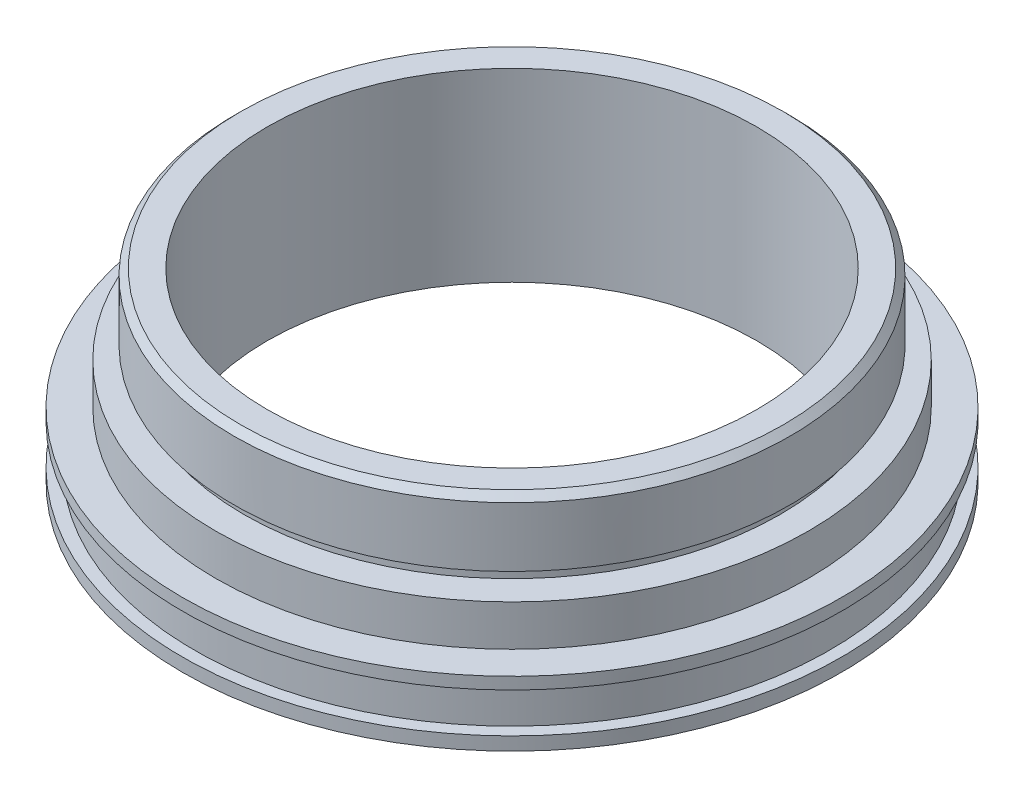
ISO-10303-21;
HEADER;
FILE_DESCRIPTION(('STEP AP214'),'2;1');
FILE_NAME('part.step','',(''),(''),'','','');
FILE_SCHEMA(('AUTOMOTIVE_DESIGN { 1 0 10303 214 1 1 1 1 }'));
ENDSEC;
DATA;
#1=APPLICATION_CONTEXT('core data for automotive mechanical design processes');
#2=APPLICATION_PROTOCOL_DEFINITION('international standard','automotive_design',2000,#1);
#3=PRODUCT_CONTEXT('',#1,'mechanical');
#4=PRODUCT('Part','Part','',(#3));
#5=PRODUCT_RELATED_PRODUCT_CATEGORY('part','',(#4));
#6=PRODUCT_DEFINITION_FORMATION('','',#4);
#7=PRODUCT_DEFINITION_CONTEXT('part definition',#1,'design');
#8=PRODUCT_DEFINITION('design','',#6,#7);
#9=PRODUCT_DEFINITION_SHAPE('','',#8);
#10=(LENGTH_UNIT() NAMED_UNIT(*) SI_UNIT(.MILLI.,.METRE.));
#11=(NAMED_UNIT(*) PLANE_ANGLE_UNIT() SI_UNIT($,.RADIAN.));
#12=(NAMED_UNIT(*) SI_UNIT($,.STERADIAN.) SOLID_ANGLE_UNIT());
#13=UNCERTAINTY_MEASURE_WITH_UNIT(LENGTH_MEASURE(1.E-05),#10,'distance_accuracy_value','');
#14=(GEOMETRIC_REPRESENTATION_CONTEXT(3) GLOBAL_UNCERTAINTY_ASSIGNED_CONTEXT((#13)) GLOBAL_UNIT_ASSIGNED_CONTEXT((#10,
#11,#12)) REPRESENTATION_CONTEXT('',''));
#15=CARTESIAN_POINT('',(0.,0.,0.));
#16=DIRECTION('',(0.,0.,1.));
#17=DIRECTION('',(1.,0.,0.));
#18=AXIS2_PLACEMENT_3D('',#15,#16,#17);
#19=CARTESIAN_POINT('',(0.,14.,0.));
#20=DIRECTION('',(0.,-1.,0.));
#21=DIRECTION('',(0.,0.,-1.));
#22=AXIS2_PLACEMENT_3D('',#19,#20,#21);
#23=CYLINDRICAL_SURFACE('',#22,21.);
#24=CARTESIAN_POINT('',(0.,13.5,0.));
#25=DIRECTION('',(0.,1.,0.));
#26=DIRECTION('',(0.,0.,1.));
#27=AXIS2_PLACEMENT_3D('',#24,#25,#26);
#28=CIRCLE('',#27,21.);
#29=CARTESIAN_POINT('',(0.,13.5,21.));
#30=VERTEX_POINT('',#29);
#31=EDGE_CURVE('E10',#30,#30,#28,.F.);
#32=ORIENTED_EDGE('',*,*,#31,.T.);
#33=EDGE_LOOP('',(#32));
#34=FACE_BOUND('',#33,.T.);
#35=CARTESIAN_POINT('',(0.,9.,0.));
#36=DIRECTION('',(0.,-1.,0.));
#37=DIRECTION('',(0.,0.,-1.));
#38=AXIS2_PLACEMENT_3D('',#35,#36,#37);
#39=CIRCLE('',#38,21.);
#40=CARTESIAN_POINT('',(0.,9.,-21.));
#41=VERTEX_POINT('',#40);
#42=EDGE_CURVE('E74',#41,#41,#39,.T.);
#43=ORIENTED_EDGE('',*,*,#42,.F.);
#44=EDGE_LOOP('',(#43));
#45=FACE_BOUND('',#44,.T.);
#46=ADVANCED_FACE('F30',(#34,#45),#23,.T.);
#47=CARTESIAN_POINT('',(0.,4.9,0.));
#48=DIRECTION('',(0.,-1.,0.));
#49=DIRECTION('',(0.,0.,-1.));
#50=AXIS2_PLACEMENT_3D('',#47,#48,#49);
#51=CYLINDRICAL_SURFACE('',#50,24.9);
#52=CARTESIAN_POINT('',(0.,4.9,0.));
#53=DIRECTION('',(0.,1.,0.));
#54=DIRECTION('',(0.,0.,1.));
#55=AXIS2_PLACEMENT_3D('',#52,#53,#54);
#56=CIRCLE('',#55,24.9);
#57=CARTESIAN_POINT('',(0.,4.9,24.9));
#58=VERTEX_POINT('',#57);
#59=EDGE_CURVE('E41',#58,#58,#56,.T.);
#60=ORIENTED_EDGE('',*,*,#59,.F.);
#61=EDGE_LOOP('',(#60));
#62=FACE_BOUND('',#61,.T.);
#63=CARTESIAN_POINT('',(0.,4.,0.));
#64=DIRECTION('',(0.,-1.,0.));
#65=DIRECTION('',(0.,0.,-1.));
#66=AXIS2_PLACEMENT_3D('',#63,#64,#65);
#67=CIRCLE('',#66,24.9);
#68=CARTESIAN_POINT('',(0.,4.,-24.9));
#69=VERTEX_POINT('',#68);
#70=EDGE_CURVE('E60',#69,#69,#67,.T.);
#71=ORIENTED_EDGE('',*,*,#70,.F.);
#72=EDGE_LOOP('',(#71));
#73=FACE_BOUND('',#72,.T.);
#74=ADVANCED_FACE('F100',(#62,#73),#51,.T.);
#75=CARTESIAN_POINT('',(0.,0.,0.));
#76=DIRECTION('',(0.,1.,0.));
#77=DIRECTION('',(0.,0.,1.));
#78=AXIS2_PLACEMENT_3D('',#75,#76,#77);
#79=CIRCLE('',#78,24.9);
#80=CARTESIAN_POINT('',(0.,0.,24.9));
#81=VERTEX_POINT('',#80);
#82=EDGE_CURVE('E45',#81,#81,#79,.T.);
#83=ORIENTED_EDGE('',*,*,#82,.T.);
#84=EDGE_LOOP('',(#83));
#85=FACE_BOUND('',#84,.T.);
#86=CARTESIAN_POINT('',(0.,1.,0.));
#87=DIRECTION('',(0.,-1.,0.));
#88=DIRECTION('',(0.,0.,-1.));
#89=AXIS2_PLACEMENT_3D('',#86,#87,#88);
#90=CIRCLE('',#89,24.9);
#91=CARTESIAN_POINT('',(0.,1.,-24.9));
#92=VERTEX_POINT('',#91);
#93=EDGE_CURVE('E71',#92,#92,#90,.T.);
#94=ORIENTED_EDGE('',*,*,#93,.T.);
#95=EDGE_LOOP('',(#94));
#96=FACE_BOUND('',#95,.T.);
#97=ADVANCED_FACE('F105',(#85,#96),#51,.T.);
#98=CARTESIAN_POINT('',(0.,8.,0.));
#99=DIRECTION('',(0.,1.,0.));
#100=DIRECTION('',(0.,0.,1.));
#101=AXIS2_PLACEMENT_3D('',#98,#99,#100);
#102=PLANE('',#101);
#103=CARTESIAN_POINT('',(0.,8.,0.));
#104=DIRECTION('',(0.,1.,0.));
#105=DIRECTION('',(0.,0.,1.));
#106=AXIS2_PLACEMENT_3D('',#103,#104,#105);
#107=CIRCLE('',#106,22.4);
#108=CARTESIAN_POINT('',(0.,8.,-22.4));
#109=VERTEX_POINT('',#108);
#110=EDGE_CURVE('E49',#109,#109,#107,.T.);
#111=ORIENTED_EDGE('',*,*,#110,.T.);
#112=EDGE_LOOP('',(#111));
#113=FACE_BOUND('',#112,.T.);
#114=CARTESIAN_POINT('',(0.,8.,0.));
#115=DIRECTION('',(0.,-1.,0.));
#116=DIRECTION('',(0.,0.,-1.));
#117=AXIS2_PLACEMENT_3D('',#114,#115,#116);
#118=CIRCLE('',#117,20.25);
#119=CARTESIAN_POINT('',(0.,8.,-20.25));
#120=VERTEX_POINT('',#119);
#121=EDGE_CURVE('E80',#120,#120,#118,.T.);
#122=ORIENTED_EDGE('',*,*,#121,.T.);
#123=EDGE_LOOP('',(#122));
#124=FACE_BOUND('',#123,.T.);
#125=ADVANCED_FACE('F84',(#113,#124),#102,.T.);
#126=CARTESIAN_POINT('',(0.,4.9,0.));
#127=DIRECTION('',(0.,1.,0.));
#128=DIRECTION('',(0.,0.,1.));
#129=AXIS2_PLACEMENT_3D('',#126,#127,#128);
#130=PLANE('',#129);
#131=ORIENTED_EDGE('',*,*,#59,.T.);
#132=EDGE_LOOP('',(#131));
#133=FACE_BOUND('',#132,.T.);
#134=CARTESIAN_POINT('',(0.,4.9,0.));
#135=DIRECTION('',(0.,1.,0.));
#136=DIRECTION('',(0.,0.,1.));
#137=AXIS2_PLACEMENT_3D('',#134,#135,#136);
#138=CIRCLE('',#137,22.4);
#139=CARTESIAN_POINT('',(0.,4.9,-22.4));
#140=VERTEX_POINT('',#139);
#141=EDGE_CURVE('E51',#140,#140,#138,.T.);
#142=ORIENTED_EDGE('',*,*,#141,.F.);
#143=EDGE_LOOP('',(#142));
#144=FACE_BOUND('',#143,.T.);
#145=ADVANCED_FACE('F114',(#133,#144),#130,.T.);
#146=CARTESIAN_POINT('',(0.,0.,0.));
#147=DIRECTION('',(0.,1.,0.));
#148=DIRECTION('',(0.,0.,1.));
#149=AXIS2_PLACEMENT_3D('',#146,#147,#148);
#150=PLANE('',#149);
#151=CARTESIAN_POINT('',(0.,0.,0.));
#152=DIRECTION('',(0.,1.,0.));
#153=DIRECTION('',(0.,0.,1.));
#154=AXIS2_PLACEMENT_3D('',#151,#152,#153);
#155=CIRCLE('',#154,18.5);
#156=CARTESIAN_POINT('',(0.,0.,18.5));
#157=VERTEX_POINT('',#156);
#158=EDGE_CURVE('E54',#157,#157,#155,.T.);
#159=ORIENTED_EDGE('',*,*,#158,.T.);
#160=EDGE_LOOP('',(#159));
#161=FACE_BOUND('',#160,.T.);
#162=ORIENTED_EDGE('',*,*,#82,.F.);
#163=EDGE_LOOP('',(#162));
#164=FACE_BOUND('',#163,.T.);
#165=ADVANCED_FACE('F119',(#161,#164),#150,.F.);
#166=CARTESIAN_POINT('',(0.,8.,0.));
#167=DIRECTION('',(0.,-1.,0.));
#168=DIRECTION('',(0.,0.,-1.));
#169=AXIS2_PLACEMENT_3D('',#166,#167,#168);
#170=CYLINDRICAL_SURFACE('',#169,22.4);
#171=CARTESIAN_POINT('',(0.,8.,-22.4));
#172=CARTESIAN_POINT('',(0.,7.96770833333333,-22.4));
#173=CARTESIAN_POINT('',(0.,7.93541666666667,-22.4));
#174=CARTESIAN_POINT('',(0.,7.87083333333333,-22.4));
#175=CARTESIAN_POINT('',(0.,7.83854166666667,-22.4));
#176=CARTESIAN_POINT('',(0.,7.77395833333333,-22.4));
#177=CARTESIAN_POINT('',(0.,7.74166666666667,-22.4));
#178=CARTESIAN_POINT('',(0.,7.67708333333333,-22.4));
#179=CARTESIAN_POINT('',(0.,7.64479166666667,-22.4));
#180=CARTESIAN_POINT('',(0.,7.58020833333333,-22.4));
#181=CARTESIAN_POINT('',(0.,7.54791666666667,-22.4));
#182=CARTESIAN_POINT('',(0.,7.48333333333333,-22.4));
#183=CARTESIAN_POINT('',(0.,7.45104166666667,-22.4));
#184=CARTESIAN_POINT('',(0.,7.38645833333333,-22.4));
#185=CARTESIAN_POINT('',(0.,7.35416666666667,-22.4));
#186=CARTESIAN_POINT('',(0.,7.28958333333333,-22.4));
#187=CARTESIAN_POINT('',(0.,7.25729166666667,-22.4));
#188=CARTESIAN_POINT('',(0.,7.19270833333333,-22.4));
#189=CARTESIAN_POINT('',(0.,7.16041666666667,-22.4));
#190=CARTESIAN_POINT('',(0.,7.09583333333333,-22.4));
#191=CARTESIAN_POINT('',(0.,7.06354166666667,-22.4));
#192=CARTESIAN_POINT('',(0.,6.99895833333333,-22.4));
#193=CARTESIAN_POINT('',(0.,6.96666666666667,-22.4));
#194=CARTESIAN_POINT('',(0.,6.90208333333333,-22.4));
#195=CARTESIAN_POINT('',(0.,6.86979166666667,-22.4));
#196=CARTESIAN_POINT('',(0.,6.80520833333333,-22.4));
#197=CARTESIAN_POINT('',(0.,6.77291666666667,-22.4));
#198=CARTESIAN_POINT('',(0.,6.70833333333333,-22.4));
#199=CARTESIAN_POINT('',(0.,6.67604166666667,-22.4));
#200=CARTESIAN_POINT('',(0.,6.61145833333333,-22.4));
#201=CARTESIAN_POINT('',(0.,6.57916666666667,-22.4));
#202=CARTESIAN_POINT('',(0.,6.51458333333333,-22.4));
#203=CARTESIAN_POINT('',(0.,6.48229166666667,-22.4));
#204=CARTESIAN_POINT('',(0.,6.41770833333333,-22.4));
#205=CARTESIAN_POINT('',(0.,6.38541666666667,-22.4));
#206=CARTESIAN_POINT('',(0.,6.32083333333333,-22.4));
#207=CARTESIAN_POINT('',(0.,6.28854166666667,-22.4));
#208=CARTESIAN_POINT('',(0.,6.22395833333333,-22.4));
#209=CARTESIAN_POINT('',(0.,6.19166666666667,-22.4));
#210=CARTESIAN_POINT('',(0.,6.12708333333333,-22.4));
#211=CARTESIAN_POINT('',(0.,6.09479166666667,-22.4));
#212=CARTESIAN_POINT('',(0.,6.03020833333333,-22.4));
#213=CARTESIAN_POINT('',(0.,5.99791666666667,-22.4));
#214=CARTESIAN_POINT('',(0.,5.93333333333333,-22.4));
#215=CARTESIAN_POINT('',(0.,5.90104166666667,-22.4));
#216=CARTESIAN_POINT('',(0.,5.83645833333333,-22.4));
#217=CARTESIAN_POINT('',(0.,5.80416666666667,-22.4));
#218=CARTESIAN_POINT('',(0.,5.73958333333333,-22.4));
#219=CARTESIAN_POINT('',(0.,5.70729166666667,-22.4));
#220=CARTESIAN_POINT('',(0.,5.64270833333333,-22.4));
#221=CARTESIAN_POINT('',(0.,5.61041666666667,-22.4));
#222=CARTESIAN_POINT('',(0.,5.54583333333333,-22.4));
#223=CARTESIAN_POINT('',(0.,5.51354166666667,-22.4));
#224=CARTESIAN_POINT('',(0.,5.44895833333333,-22.4));
#225=CARTESIAN_POINT('',(0.,5.41666666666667,-22.4));
#226=CARTESIAN_POINT('',(0.,5.35208333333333,-22.4));
#227=CARTESIAN_POINT('',(0.,5.31979166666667,-22.4));
#228=CARTESIAN_POINT('',(0.,5.25520833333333,-22.4));
#229=CARTESIAN_POINT('',(0.,5.22291666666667,-22.4));
#230=CARTESIAN_POINT('',(0.,5.15833333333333,-22.4));
#231=CARTESIAN_POINT('',(0.,5.12604166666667,-22.4));
#232=CARTESIAN_POINT('',(0.,5.06145833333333,-22.4));
#233=CARTESIAN_POINT('',(0.,5.02916666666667,-22.4));
#234=CARTESIAN_POINT('',(0.,4.96458333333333,-22.4));
#235=CARTESIAN_POINT('',(0.,4.93229166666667,-22.4));
#236=CARTESIAN_POINT('',(0.,4.9,-22.4));
#237=B_SPLINE_CURVE_WITH_KNOTS('',3,(#171,#172,#173,#174,#175,#176,#177,#178,#179,#180,#181,
#182,#183,#184,#185,#186,#187,#188,#189,#190,#191,#192,#193,#194,#195,#196,#197,#198,#199,#200,
#201,#202,#203,#204,#205,#206,#207,#208,#209,#210,#211,#212,#213,#214,#215,#216,#217,#218,#219,
#220,#221,#222,#223,#224,#225,#226,#227,#228,#229,#230,#231,#232,#233,#234,#235,#236),
.UNSPECIFIED.,.F.,.F.,(4,2,2,2,2,2,2,2,2,2,2,2,2,2,2,2,2,2,2,2,2,2,2,2,2,2,2,2,2,2,2,2,4),(0.,
0.0968749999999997,0.193749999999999,0.290624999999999,0.387499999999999,0.484374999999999,
0.581249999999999,0.678124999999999,0.774999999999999,0.871874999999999,0.968749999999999,
1.065625,1.1625,1.259375,1.35625,1.453125,1.55,1.646875,1.74375,1.840625,1.9375,2.034375,
2.13125,2.228125,2.325,2.421875,2.51875,2.615625,2.7125,2.809375,2.90625,3.003125,3.1),.UNSPECIFIED.);
#238=EDGE_CURVE('BSEAM116',#109,#140,#237,.T.);
#239=ORIENTED_EDGE('',*,*,#110,.F.);
#240=ORIENTED_EDGE('',*,*,#141,.T.);
#241=ORIENTED_EDGE('',*,*,#238,.T.);
#242=ORIENTED_EDGE('',*,*,#238,.F.);
#243=EDGE_LOOP('',(#239,#241,#240,#242));
#244=FACE_BOUND('',#243,.T.);
#245=ADVANCED_FACE('F116',(#244),#170,.T.);
#246=CARTESIAN_POINT('',(0.,14.,0.));
#247=DIRECTION('',(0.,1.,0.));
#248=DIRECTION('',(0.,0.,1.));
#249=AXIS2_PLACEMENT_3D('',#246,#247,#248);
#250=PLANE('',#249);
#251=CARTESIAN_POINT('',(0.,14.,0.));
#252=DIRECTION('',(0.,1.,0.));
#253=DIRECTION('',(0.,0.,1.));
#254=AXIS2_PLACEMENT_3D('',#251,#252,#253);
#255=CIRCLE('',#254,20.5);
#256=CARTESIAN_POINT('',(0.,14.,20.5));
#257=VERTEX_POINT('',#256);
#258=EDGE_CURVE('E37',#257,#257,#255,.T.);
#259=ORIENTED_EDGE('',*,*,#258,.T.);
#260=EDGE_LOOP('',(#259));
#261=FACE_BOUND('',#260,.T.);
#262=CARTESIAN_POINT('',(0.,14.,0.));
#263=DIRECTION('',(0.,1.,0.));
#264=DIRECTION('',(0.,0.,1.));
#265=AXIS2_PLACEMENT_3D('',#262,#263,#264);
#266=CIRCLE('',#265,18.5);
#267=CARTESIAN_POINT('',(0.,14.,18.5));
#268=VERTEX_POINT('',#267);
#269=EDGE_CURVE('E57',#268,#268,#266,.T.);
#270=ORIENTED_EDGE('',*,*,#269,.F.);
#271=EDGE_LOOP('',(#270));
#272=FACE_BOUND('',#271,.T.);
#273=ADVANCED_FACE('F110',(#261,#272),#250,.T.);
#274=CARTESIAN_POINT('',(0.,0.,0.));
#275=DIRECTION('',(0.,1.,0.));
#276=DIRECTION('',(0.,0.,1.));
#277=AXIS2_PLACEMENT_3D('',#274,#275,#276);
#278=CYLINDRICAL_SURFACE('',#277,18.5);
#279=ORIENTED_EDGE('',*,*,#158,.F.);
#280=EDGE_LOOP('',(#279));
#281=FACE_BOUND('',#280,.T.);
#282=ORIENTED_EDGE('',*,*,#269,.T.);
#283=EDGE_LOOP('',(#282));
#284=FACE_BOUND('',#283,.T.);
#285=ADVANCED_FACE('F148',(#281,#284),#278,.F.);
#286=CARTESIAN_POINT('',(0.,4.,24.9));
#287=DIRECTION('',(0.,-1.,0.));
#288=DIRECTION('',(0.,0.,-1.));
#289=AXIS2_PLACEMENT_3D('',#286,#287,#288);
#290=PLANE('',#289);
#291=ORIENTED_EDGE('',*,*,#70,.T.);
#292=EDGE_LOOP('',(#291));
#293=FACE_BOUND('',#292,.T.);
#294=CARTESIAN_POINT('',(0.,4.,0.));
#295=DIRECTION('',(0.,-1.,0.));
#296=DIRECTION('',(0.,0.,-1.));
#297=AXIS2_PLACEMENT_3D('',#294,#295,#296);
#298=CIRCLE('',#297,24.);
#299=CARTESIAN_POINT('',(0.,4.,-24.));
#300=VERTEX_POINT('',#299);
#301=EDGE_CURVE('E65',#300,#300,#298,.T.);
#302=ORIENTED_EDGE('',*,*,#301,.F.);
#303=EDGE_LOOP('',(#302));
#304=FACE_BOUND('',#303,.T.);
#305=ADVANCED_FACE('F143',(#293,#304),#290,.T.);
#306=CARTESIAN_POINT('',(0.,0.,0.));
#307=DIRECTION('',(0.,-1.,0.));
#308=DIRECTION('',(0.,0.,-1.));
#309=AXIS2_PLACEMENT_3D('',#306,#307,#308);
#310=CYLINDRICAL_SURFACE('',#309,24.);
#311=ORIENTED_EDGE('',*,*,#301,.T.);
#312=EDGE_LOOP('',(#311));
#313=FACE_BOUND('',#312,.T.);
#314=CARTESIAN_POINT('',(0.,1.,0.));
#315=DIRECTION('',(0.,-1.,0.));
#316=DIRECTION('',(0.,0.,-1.));
#317=AXIS2_PLACEMENT_3D('',#314,#315,#316);
#318=CIRCLE('',#317,24.);
#319=CARTESIAN_POINT('',(0.,1.,-24.));
#320=VERTEX_POINT('',#319);
#321=EDGE_CURVE('E68',#320,#320,#318,.T.);
#322=ORIENTED_EDGE('',*,*,#321,.F.);
#323=EDGE_LOOP('',(#322));
#324=FACE_BOUND('',#323,.T.);
#325=ADVANCED_FACE('F137',(#313,#324),#310,.T.);
#326=CARTESIAN_POINT('',(0.,1.,24.9));
#327=DIRECTION('',(0.,1.,0.));
#328=DIRECTION('',(0.,0.,1.));
#329=AXIS2_PLACEMENT_3D('',#326,#327,#328);
#330=PLANE('',#329);
#331=ORIENTED_EDGE('',*,*,#321,.T.);
#332=EDGE_LOOP('',(#331));
#333=FACE_BOUND('',#332,.T.);
#334=ORIENTED_EDGE('',*,*,#93,.F.);
#335=EDGE_LOOP('',(#334));
#336=FACE_BOUND('',#335,.T.);
#337=ADVANCED_FACE('F96',(#333,#336),#330,.T.);
#338=CARTESIAN_POINT('',(0.,9.,21.));
#339=DIRECTION('',(0.,-1.,0.));
#340=DIRECTION('',(0.,0.,-1.));
#341=AXIS2_PLACEMENT_3D('',#338,#339,#340);
#342=PLANE('',#341);
#343=ORIENTED_EDGE('',*,*,#42,.T.);
#344=EDGE_LOOP('',(#343));
#345=FACE_BOUND('',#344,.T.);
#346=CARTESIAN_POINT('',(0.,9.,0.));
#347=DIRECTION('',(0.,-1.,0.));
#348=DIRECTION('',(0.,0.,-1.));
#349=AXIS2_PLACEMENT_3D('',#346,#347,#348);
#350=CIRCLE('',#349,20.25);
#351=CARTESIAN_POINT('',(0.,9.,-20.25));
#352=VERTEX_POINT('',#351);
#353=EDGE_CURVE('E77',#352,#352,#350,.T.);
#354=ORIENTED_EDGE('',*,*,#353,.F.);
#355=EDGE_LOOP('',(#354));
#356=FACE_BOUND('',#355,.T.);
#357=ADVANCED_FACE('F88',(#345,#356),#342,.T.);
#358=CARTESIAN_POINT('',(0.,0.,0.));
#359=DIRECTION('',(0.,-1.,0.));
#360=DIRECTION('',(0.,0.,-1.));
#361=AXIS2_PLACEMENT_3D('',#358,#359,#360);
#362=CYLINDRICAL_SURFACE('',#361,20.25);
#363=ORIENTED_EDGE('',*,*,#353,.T.);
#364=EDGE_LOOP('',(#363));
#365=FACE_BOUND('',#364,.T.);
#366=ORIENTED_EDGE('',*,*,#121,.F.);
#367=EDGE_LOOP('',(#366));
#368=FACE_BOUND('',#367,.T.);
#369=ADVANCED_FACE('F86',(#365,#368),#362,.T.);
#370=CARTESIAN_POINT('',(0.,14.,0.));
#371=DIRECTION('',(0.,-1.,0.));
#372=DIRECTION('',(0.,0.,-1.));
#373=AXIS2_PLACEMENT_3D('',#370,#371,#372);
#374=CONICAL_SURFACE('',#373,20.5,0.785398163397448);
#375=ORIENTED_EDGE('',*,*,#31,.F.);
#376=EDGE_LOOP('',(#375));
#377=FACE_BOUND('',#376,.T.);
#378=ORIENTED_EDGE('',*,*,#258,.F.);
#379=EDGE_LOOP('',(#378));
#380=FACE_BOUND('',#379,.T.);
#381=ADVANCED_FACE('F32',(#377,#380),#374,.T.);
#382=CLOSED_SHELL('',(#46,#74,#97,#125,#145,#165,#245,#273,#285,#305,#325,#337,#357,#369,#381));
#383=MANIFOLD_SOLID_BREP('B2',#382);
#384=ADVANCED_BREP_SHAPE_REPRESENTATION('',(#18,#383),#14);
#385=SHAPE_DEFINITION_REPRESENTATION(#9,#384);
ENDSEC;
END-ISO-10303-21;
